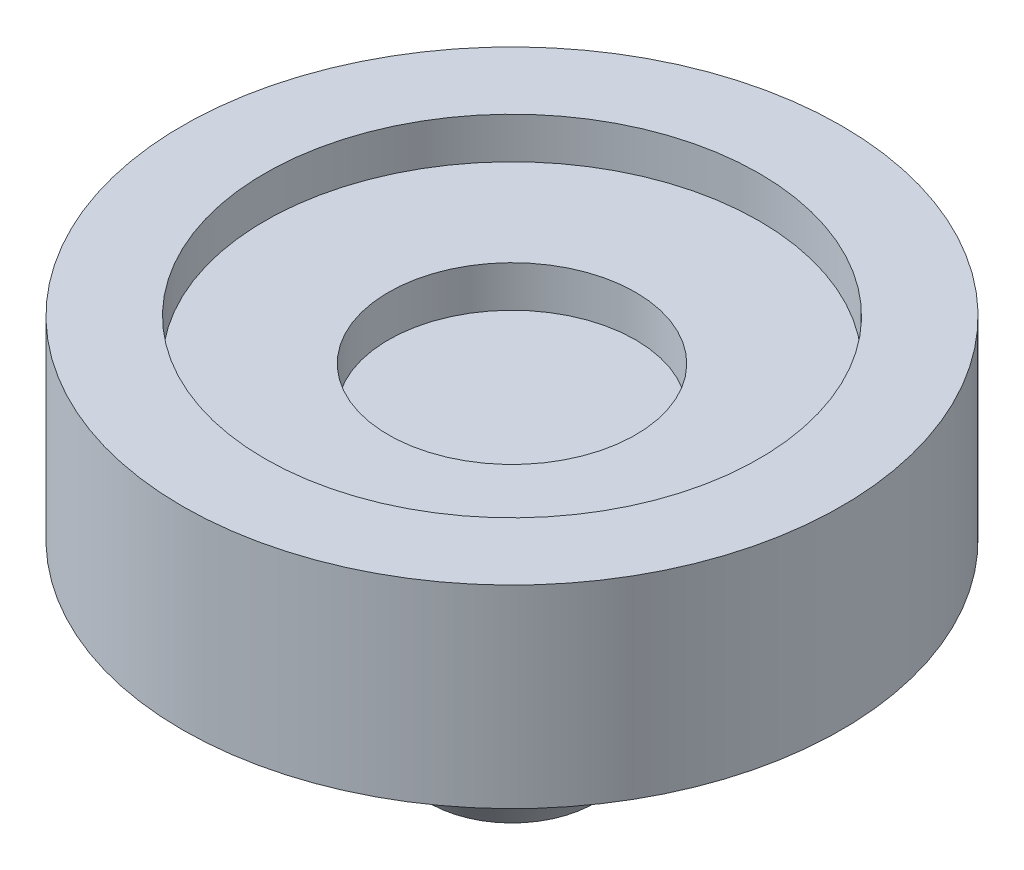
from build123d import *


with BuildPart() as part:
    # Esquisse1 → R_volution1 (revolve)
    with BuildSketch(Plane.XY, mode=Mode.PRIVATE) as r_volution1_sk:
        with BuildLine():
            Line((0, 0), (0, 77))
            Line((0, 77), (-30, 77))
            Line((-30, 77), (-30, 87))
            Line((-30, 87), (-60, 87))
            Line((-60, 87), (-60, 97))
            Line((-60, 97), (-80, 97))
            Line((-80, 97), (-80, 50))
            Line((-80, 50), (-50, 50))
            Line((-50, 50), (-20, 4.550819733))
            ThreePointArc((-20, 4.550819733), (-14.183705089, 1.791000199), (-8, 0))
            Line((-8, 0), (0, 0))
        make_face()
    revolve(r_volution1_sk.sketch.rotate(Axis((0, -213.825284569, 0), (0, 1, 0)), 270), axis=Axis((0, -213.825284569, 0), (0, 1, 0)))


solid = part.part
